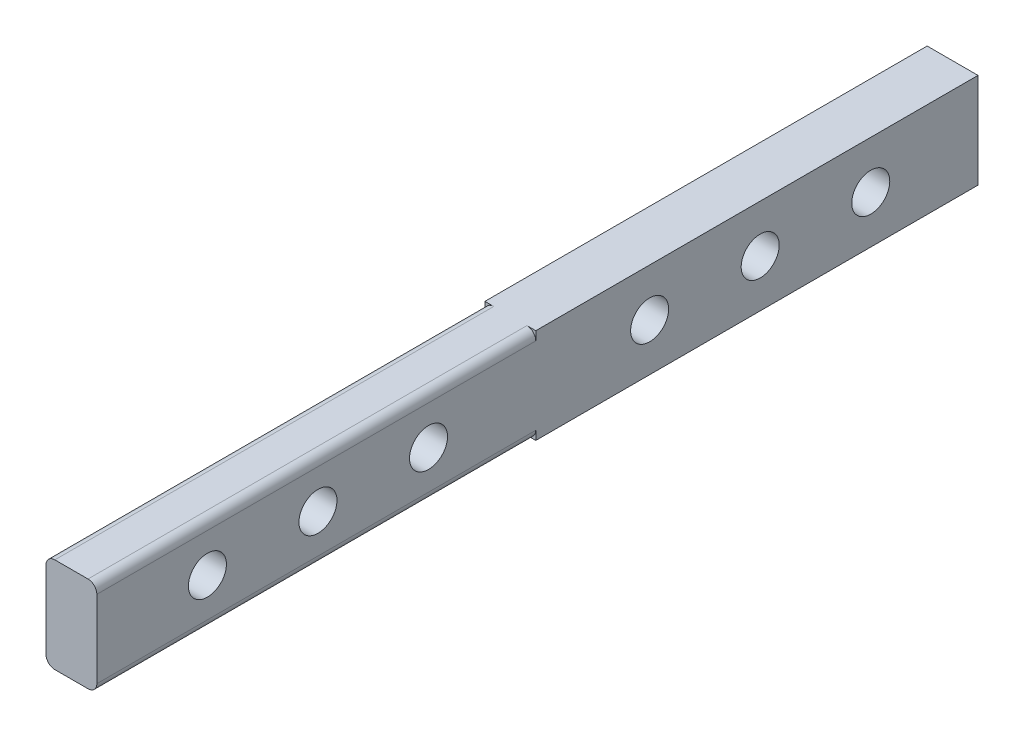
ISO-10303-21;
HEADER;
FILE_DESCRIPTION(('STEP AP214'),'2;1');
FILE_NAME('part.step','',(''),(''),'','','');
FILE_SCHEMA(('AUTOMOTIVE_DESIGN { 1 0 10303 214 1 1 1 1 }'));
ENDSEC;
DATA;
#1=APPLICATION_CONTEXT('core data for automotive mechanical design processes');
#2=APPLICATION_PROTOCOL_DEFINITION('international standard','automotive_design',2000,#1);
#3=PRODUCT_CONTEXT('',#1,'mechanical');
#4=PRODUCT('Part','Part','',(#3));
#5=PRODUCT_RELATED_PRODUCT_CATEGORY('part','',(#4));
#6=PRODUCT_DEFINITION_FORMATION('','',#4);
#7=PRODUCT_DEFINITION_CONTEXT('part definition',#1,'design');
#8=PRODUCT_DEFINITION('design','',#6,#7);
#9=PRODUCT_DEFINITION_SHAPE('','',#8);
#10=(LENGTH_UNIT() NAMED_UNIT(*) SI_UNIT(.MILLI.,.METRE.));
#11=(NAMED_UNIT(*) PLANE_ANGLE_UNIT() SI_UNIT($,.RADIAN.));
#12=(NAMED_UNIT(*) SI_UNIT($,.STERADIAN.) SOLID_ANGLE_UNIT());
#13=UNCERTAINTY_MEASURE_WITH_UNIT(LENGTH_MEASURE(1.E-05),#10,'distance_accuracy_value','');
#14=(GEOMETRIC_REPRESENTATION_CONTEXT(3) GLOBAL_UNCERTAINTY_ASSIGNED_CONTEXT((#13)) GLOBAL_UNIT_ASSIGNED_CONTEXT((#10,
#11,#12)) REPRESENTATION_CONTEXT('',''));
#15=CARTESIAN_POINT('',(0.,0.,0.));
#16=DIRECTION('',(0.,0.,1.));
#17=DIRECTION('',(1.,0.,0.));
#18=AXIS2_PLACEMENT_3D('',#15,#16,#17);
#19=CARTESIAN_POINT('',(2.875,5.375,49.6264199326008));
#20=DIRECTION('',(-1.,0.,0.));
#21=DIRECTION('',(0.,0.,1.));
#22=AXIS2_PLACEMENT_3D('',#19,#20,#21);
#23=PLANE('',#22);
#24=CARTESIAN_POINT('',(2.875,0.,37.1264199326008));
#25=DIRECTION('',(1.,0.,0.));
#26=DIRECTION('',(0.,0.,-1.));
#27=AXIS2_PLACEMENT_3D('',#24,#25,#26);
#28=CIRCLE('',#27,2.15);
#29=CARTESIAN_POINT('',(2.875,0.,34.9764199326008));
#30=VERTEX_POINT('',#29);
#31=EDGE_CURVE('E227',#30,#30,#28,.T.);
#32=ORIENTED_EDGE('',*,*,#31,.F.);
#33=EDGE_LOOP('',(#32));
#34=FACE_BOUND('',#33,.T.);
#35=CARTESIAN_POINT('',(2.875,0.,24.6264199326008));
#36=DIRECTION('',(1.,0.,0.));
#37=DIRECTION('',(0.,0.,-1.));
#38=AXIS2_PLACEMENT_3D('',#35,#36,#37);
#39=CIRCLE('',#38,2.15);
#40=CARTESIAN_POINT('',(2.875,0.,22.4764199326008));
#41=VERTEX_POINT('',#40);
#42=EDGE_CURVE('E237',#41,#41,#39,.T.);
#43=ORIENTED_EDGE('',*,*,#42,.F.);
#44=EDGE_LOOP('',(#43));
#45=FACE_BOUND('',#44,.T.);
#46=CARTESIAN_POINT('',(2.875,0.,12.1264199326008));
#47=DIRECTION('',(1.,0.,0.));
#48=DIRECTION('',(0.,0.,-1.));
#49=AXIS2_PLACEMENT_3D('',#46,#47,#48);
#50=CIRCLE('',#49,2.15);
#51=CARTESIAN_POINT('',(2.875,0.,9.97641993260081));
#52=VERTEX_POINT('',#51);
#53=EDGE_CURVE('E243',#52,#52,#50,.T.);
#54=ORIENTED_EDGE('',*,*,#53,.F.);
#55=EDGE_LOOP('',(#54));
#56=FACE_BOUND('',#55,.T.);
#57=CARTESIAN_POINT('',(2.875,0.,-12.8735800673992));
#58=DIRECTION('',(1.,0.,0.));
#59=DIRECTION('',(0.,0.,-1.));
#60=AXIS2_PLACEMENT_3D('',#57,#58,#59);
#61=CIRCLE('',#60,2.15);
#62=CARTESIAN_POINT('',(2.875,0.,-15.0235800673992));
#63=VERTEX_POINT('',#62);
#64=EDGE_CURVE('E249',#63,#63,#61,.T.);
#65=ORIENTED_EDGE('',*,*,#64,.F.);
#66=EDGE_LOOP('',(#65));
#67=FACE_BOUND('',#66,.T.);
#68=CARTESIAN_POINT('',(2.875,0.,-25.3735800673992));
#69=DIRECTION('',(1.,0.,0.));
#70=DIRECTION('',(0.,0.,-1.));
#71=AXIS2_PLACEMENT_3D('',#68,#69,#70);
#72=CIRCLE('',#71,2.15);
#73=CARTESIAN_POINT('',(2.875,0.,-27.5235800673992));
#74=VERTEX_POINT('',#73);
#75=EDGE_CURVE('E255',#74,#74,#72,.T.);
#76=ORIENTED_EDGE('',*,*,#75,.F.);
#77=EDGE_LOOP('',(#76));
#78=FACE_BOUND('',#77,.T.);
#79=CARTESIAN_POINT('',(2.875,0.,-37.8735800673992));
#80=DIRECTION('',(1.,0.,0.));
#81=DIRECTION('',(0.,0.,-1.));
#82=AXIS2_PLACEMENT_3D('',#79,#80,#81);
#83=CIRCLE('',#82,2.15);
#84=CARTESIAN_POINT('',(2.875,0.,-40.0235800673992));
#85=VERTEX_POINT('',#84);
#86=EDGE_CURVE('E157',#85,#85,#83,.T.);
#87=ORIENTED_EDGE('',*,*,#86,.F.);
#88=EDGE_LOOP('',(#87));
#89=FACE_BOUND('',#88,.T.);
#90=DIRECTION('',(0.,1.,0.));
#91=VECTOR('',#90,1.);
#92=CARTESIAN_POINT('',(2.875,5.375,49.6264199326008));
#93=LINE('',#92,#91);
#94=CARTESIAN_POINT('',(2.875,-4.375,49.6264199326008));
#95=VERTEX_POINT('',#94);
#96=CARTESIAN_POINT('',(2.875,4.375,49.6264199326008));
#97=VERTEX_POINT('',#96);
#98=EDGE_CURVE('E173',#95,#97,#93,.T.);
#99=ORIENTED_EDGE('',*,*,#98,.F.);
#100=DIRECTION('',(0.,0.,-1.));
#101=VECTOR('',#100,1.);
#102=CARTESIAN_POINT('',(2.875,-4.375,49.6264199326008));
#103=LINE('',#102,#101);
#104=CARTESIAN_POINT('',(2.875,-4.375,0.));
#105=VERTEX_POINT('',#104);
#106=EDGE_CURVE('E189',#95,#105,#103,.T.);
#107=ORIENTED_EDGE('',*,*,#106,.T.);
#108=DIRECTION('',(0.,1.,0.));
#109=VECTOR('',#108,1.);
#110=CARTESIAN_POINT('',(2.875,5.375,0.));
#111=LINE('',#110,#109);
#112=CARTESIAN_POINT('',(2.875,-5.375,0.));
#113=VERTEX_POINT('',#112);
#114=EDGE_CURVE('E162',#113,#105,#111,.T.);
#115=ORIENTED_EDGE('',*,*,#114,.F.);
#116=DIRECTION('',(0.,0.,1.));
#117=VECTOR('',#116,1.);
#118=CARTESIAN_POINT('',(2.875,-5.375,-50.));
#119=LINE('',#118,#117);
#120=CARTESIAN_POINT('',(2.875,-5.375,-50.));
#121=VERTEX_POINT('',#120);
#122=EDGE_CURVE('E150',#121,#113,#119,.T.);
#123=ORIENTED_EDGE('',*,*,#122,.F.);
#124=DIRECTION('',(0.,1.,0.));
#125=VECTOR('',#124,1.);
#126=CARTESIAN_POINT('',(2.875,5.375,-50.));
#127=LINE('',#126,#125);
#128=CARTESIAN_POINT('',(2.875,5.375,-50.));
#129=VERTEX_POINT('',#128);
#130=EDGE_CURVE('E142',#121,#129,#127,.T.);
#131=ORIENTED_EDGE('',*,*,#130,.T.);
#132=DIRECTION('',(0.,0.,1.));
#133=VECTOR('',#132,1.);
#134=CARTESIAN_POINT('',(2.875,5.375,-50.));
#135=LINE('',#134,#133);
#136=CARTESIAN_POINT('',(2.875,5.375,0.));
#137=VERTEX_POINT('',#136);
#138=EDGE_CURVE('E123',#129,#137,#135,.T.);
#139=ORIENTED_EDGE('',*,*,#138,.T.);
#140=CARTESIAN_POINT('',(2.875,4.375,0.));
#141=VERTEX_POINT('',#140);
#142=EDGE_CURVE('E166',#141,#137,#111,.T.);
#143=ORIENTED_EDGE('',*,*,#142,.F.);
#144=DIRECTION('',(0.,0.,-1.));
#145=VECTOR('',#144,1.);
#146=CARTESIAN_POINT('',(2.875,4.375,49.6264199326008));
#147=LINE('',#146,#145);
#148=EDGE_CURVE('E187',#141,#97,#147,.F.);
#149=ORIENTED_EDGE('',*,*,#148,.T.);
#150=EDGE_LOOP('',(#99,#107,#115,#123,#131,#139,#143,#149));
#151=FACE_BOUND('',#150,.T.);
#152=ADVANCED_FACE('F33',(#34,#45,#56,#67,#78,#89,#151),#23,.F.);
#153=CARTESIAN_POINT('',(-2.875,5.375,49.6264199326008));
#154=DIRECTION('',(0.,-1.,0.));
#155=DIRECTION('',(0.,0.,-1.));
#156=AXIS2_PLACEMENT_3D('',#153,#154,#155);
#157=PLANE('',#156);
#158=DIRECTION('',(0.,0.,-1.));
#159=VECTOR('',#158,1.);
#160=CARTESIAN_POINT('',(1.875,5.375,49.6264199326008));
#161=LINE('',#160,#159);
#162=CARTESIAN_POINT('',(1.875,5.375,49.6264199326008));
#163=VERTEX_POINT('',#162);
#164=CARTESIAN_POINT('',(1.875,5.375,0.));
#165=VERTEX_POINT('',#164);
#166=EDGE_CURVE('E41',#163,#165,#161,.T.);
#167=ORIENTED_EDGE('',*,*,#166,.T.);
#168=DIRECTION('',(-1.,0.,0.));
#169=VECTOR('',#168,1.);
#170=CARTESIAN_POINT('',(-2.875,5.375,0.));
#171=LINE('',#170,#169);
#172=EDGE_CURVE('E130',#137,#165,#171,.T.);
#173=ORIENTED_EDGE('',*,*,#172,.F.);
#174=ORIENTED_EDGE('',*,*,#138,.F.);
#175=DIRECTION('',(-1.,0.,0.));
#176=VECTOR('',#175,1.);
#177=CARTESIAN_POINT('',(-2.875,5.375,-50.));
#178=LINE('',#177,#176);
#179=CARTESIAN_POINT('',(-2.875,5.375,-50.));
#180=VERTEX_POINT('',#179);
#181=EDGE_CURVE('E128',#129,#180,#178,.T.);
#182=ORIENTED_EDGE('',*,*,#181,.T.);
#183=DIRECTION('',(0.,0.,1.));
#184=VECTOR('',#183,1.);
#185=CARTESIAN_POINT('',(-2.875,5.375,-50.));
#186=LINE('',#185,#184);
#187=CARTESIAN_POINT('',(-2.875,5.375,0.));
#188=VERTEX_POINT('',#187);
#189=EDGE_CURVE('E134',#180,#188,#186,.T.);
#190=ORIENTED_EDGE('',*,*,#189,.T.);
#191=CARTESIAN_POINT('',(-1.875,5.375,0.));
#192=VERTEX_POINT('',#191);
#193=EDGE_CURVE('E165',#192,#188,#171,.T.);
#194=ORIENTED_EDGE('',*,*,#193,.F.);
#195=DIRECTION('',(0.,0.,-1.));
#196=VECTOR('',#195,1.);
#197=CARTESIAN_POINT('',(-1.875,5.375,49.6264199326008));
#198=LINE('',#197,#196);
#199=CARTESIAN_POINT('',(-1.875,5.375,49.6264199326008));
#200=VERTEX_POINT('',#199);
#201=EDGE_CURVE('E11',#192,#200,#198,.F.);
#202=ORIENTED_EDGE('',*,*,#201,.T.);
#203=DIRECTION('',(-1.,0.,0.));
#204=VECTOR('',#203,1.);
#205=CARTESIAN_POINT('',(-2.875,5.375,49.6264199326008));
#206=LINE('',#205,#204);
#207=EDGE_CURVE('E180',#163,#200,#206,.T.);
#208=ORIENTED_EDGE('',*,*,#207,.F.);
#209=EDGE_LOOP('',(#167,#173,#174,#182,#190,#194,#202,#208));
#210=FACE_BOUND('',#209,.T.);
#211=ADVANCED_FACE('F126',(#210),#157,.F.);
#212=CARTESIAN_POINT('',(-2.875,5.375,49.6264199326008));
#213=DIRECTION('',(1.,0.,0.));
#214=DIRECTION('',(0.,0.,-1.));
#215=AXIS2_PLACEMENT_3D('',#212,#213,#214);
#216=PLANE('',#215);
#217=CARTESIAN_POINT('',(-2.875,0.,37.1264199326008));
#218=DIRECTION('',(1.,0.,0.));
#219=DIRECTION('',(0.,0.,-1.));
#220=AXIS2_PLACEMENT_3D('',#217,#218,#219);
#221=CIRCLE('',#220,2.15);
#222=CARTESIAN_POINT('',(-2.875,0.,34.9764199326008));
#223=VERTEX_POINT('',#222);
#224=EDGE_CURVE('E225',#223,#223,#221,.T.);
#225=ORIENTED_EDGE('',*,*,#224,.T.);
#226=EDGE_LOOP('',(#225));
#227=FACE_BOUND('',#226,.T.);
#228=CARTESIAN_POINT('',(-2.875,0.,24.6264199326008));
#229=DIRECTION('',(1.,0.,0.));
#230=DIRECTION('',(0.,0.,-1.));
#231=AXIS2_PLACEMENT_3D('',#228,#229,#230);
#232=CIRCLE('',#231,2.15);
#233=CARTESIAN_POINT('',(-2.875,0.,22.4764199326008));
#234=VERTEX_POINT('',#233);
#235=EDGE_CURVE('E232',#234,#234,#232,.T.);
#236=ORIENTED_EDGE('',*,*,#235,.T.);
#237=EDGE_LOOP('',(#236));
#238=FACE_BOUND('',#237,.T.);
#239=CARTESIAN_POINT('',(-2.875,0.,12.1264199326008));
#240=DIRECTION('',(1.,0.,0.));
#241=DIRECTION('',(0.,0.,-1.));
#242=AXIS2_PLACEMENT_3D('',#239,#240,#241);
#243=CIRCLE('',#242,2.15);
#244=CARTESIAN_POINT('',(-2.875,0.,9.97641993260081));
#245=VERTEX_POINT('',#244);
#246=EDGE_CURVE('E240',#245,#245,#243,.T.);
#247=ORIENTED_EDGE('',*,*,#246,.T.);
#248=EDGE_LOOP('',(#247));
#249=FACE_BOUND('',#248,.T.);
#250=CARTESIAN_POINT('',(-2.875,0.,-12.8735800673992));
#251=DIRECTION('',(1.,0.,0.));
#252=DIRECTION('',(0.,0.,-1.));
#253=AXIS2_PLACEMENT_3D('',#250,#251,#252);
#254=CIRCLE('',#253,2.15);
#255=CARTESIAN_POINT('',(-2.875,0.,-15.0235800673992));
#256=VERTEX_POINT('',#255);
#257=EDGE_CURVE('E246',#256,#256,#254,.T.);
#258=ORIENTED_EDGE('',*,*,#257,.T.);
#259=EDGE_LOOP('',(#258));
#260=FACE_BOUND('',#259,.T.);
#261=CARTESIAN_POINT('',(-2.875,0.,-25.3735800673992));
#262=DIRECTION('',(1.,0.,0.));
#263=DIRECTION('',(0.,0.,-1.));
#264=AXIS2_PLACEMENT_3D('',#261,#262,#263);
#265=CIRCLE('',#264,2.15);
#266=CARTESIAN_POINT('',(-2.875,0.,-27.5235800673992));
#267=VERTEX_POINT('',#266);
#268=EDGE_CURVE('E252',#267,#267,#265,.T.);
#269=ORIENTED_EDGE('',*,*,#268,.T.);
#270=EDGE_LOOP('',(#269));
#271=FACE_BOUND('',#270,.T.);
#272=CARTESIAN_POINT('',(-2.875,0.,-37.8735800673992));
#273=DIRECTION('',(1.,0.,0.));
#274=DIRECTION('',(0.,0.,-1.));
#275=AXIS2_PLACEMENT_3D('',#272,#273,#274);
#276=CIRCLE('',#275,2.15);
#277=CARTESIAN_POINT('',(-2.875,0.,-40.0235800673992));
#278=VERTEX_POINT('',#277);
#279=EDGE_CURVE('E257',#278,#278,#276,.T.);
#280=ORIENTED_EDGE('',*,*,#279,.T.);
#281=EDGE_LOOP('',(#280));
#282=FACE_BOUND('',#281,.T.);
#283=DIRECTION('',(0.,0.,-1.));
#284=VECTOR('',#283,1.);
#285=CARTESIAN_POINT('',(-2.875,4.375,49.6264199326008));
#286=LINE('',#285,#284);
#287=CARTESIAN_POINT('',(-2.875,4.375,49.6264199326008));
#288=VERTEX_POINT('',#287);
#289=CARTESIAN_POINT('',(-2.875,4.375,0.));
#290=VERTEX_POINT('',#289);
#291=EDGE_CURVE('E216',#288,#290,#286,.T.);
#292=ORIENTED_EDGE('',*,*,#291,.T.);
#293=DIRECTION('',(0.,-1.,0.));
#294=VECTOR('',#293,1.);
#295=CARTESIAN_POINT('',(-2.875,5.375,0.));
#296=LINE('',#295,#294);
#297=EDGE_CURVE('E169',#188,#290,#296,.T.);
#298=ORIENTED_EDGE('',*,*,#297,.F.);
#299=ORIENTED_EDGE('',*,*,#189,.F.);
#300=DIRECTION('',(0.,-1.,0.));
#301=VECTOR('',#300,1.);
#302=CARTESIAN_POINT('',(-2.875,5.375,-50.));
#303=LINE('',#302,#301);
#304=CARTESIAN_POINT('',(-2.875,-5.375,-50.));
#305=VERTEX_POINT('',#304);
#306=EDGE_CURVE('E145',#180,#305,#303,.T.);
#307=ORIENTED_EDGE('',*,*,#306,.T.);
#308=DIRECTION('',(0.,0.,1.));
#309=VECTOR('',#308,1.);
#310=CARTESIAN_POINT('',(-2.875,-5.375,-50.));
#311=LINE('',#310,#309);
#312=CARTESIAN_POINT('',(-2.875,-5.375,0.));
#313=VERTEX_POINT('',#312);
#314=EDGE_CURVE('E174',#305,#313,#311,.T.);
#315=ORIENTED_EDGE('',*,*,#314,.T.);
#316=CARTESIAN_POINT('',(-2.875,-4.375,0.));
#317=VERTEX_POINT('',#316);
#318=EDGE_CURVE('E168',#317,#313,#296,.T.);
#319=ORIENTED_EDGE('',*,*,#318,.F.);
#320=DIRECTION('',(0.,0.,-1.));
#321=VECTOR('',#320,1.);
#322=CARTESIAN_POINT('',(-2.875,-4.375,49.6264199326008));
#323=LINE('',#322,#321);
#324=CARTESIAN_POINT('',(-2.875,-4.375,49.6264199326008));
#325=VERTEX_POINT('',#324);
#326=EDGE_CURVE('E48',#317,#325,#323,.F.);
#327=ORIENTED_EDGE('',*,*,#326,.T.);
#328=DIRECTION('',(0.,-1.,0.));
#329=VECTOR('',#328,1.);
#330=CARTESIAN_POINT('',(-2.875,5.375,49.6264199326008));
#331=LINE('',#330,#329);
#332=EDGE_CURVE('E182',#288,#325,#331,.T.);
#333=ORIENTED_EDGE('',*,*,#332,.F.);
#334=EDGE_LOOP('',(#292,#298,#299,#307,#315,#319,#327,#333));
#335=FACE_BOUND('',#334,.T.);
#336=ADVANCED_FACE('F272',(#227,#238,#249,#260,#271,#282,#335),#216,.F.);
#337=CARTESIAN_POINT('',(-2.875,-5.375,49.6264199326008));
#338=DIRECTION('',(0.,1.,0.));
#339=DIRECTION('',(0.,0.,1.));
#340=AXIS2_PLACEMENT_3D('',#337,#338,#339);
#341=PLANE('',#340);
#342=DIRECTION('',(0.,0.,-1.));
#343=VECTOR('',#342,1.);
#344=CARTESIAN_POINT('',(-1.875,-5.375,49.6264199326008));
#345=LINE('',#344,#343);
#346=CARTESIAN_POINT('',(-1.875,-5.375,49.6264199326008));
#347=VERTEX_POINT('',#346);
#348=CARTESIAN_POINT('',(-1.875,-5.375,0.));
#349=VERTEX_POINT('',#348);
#350=EDGE_CURVE('E204',#347,#349,#345,.T.);
#351=ORIENTED_EDGE('',*,*,#350,.T.);
#352=DIRECTION('',(1.,0.,0.));
#353=VECTOR('',#352,1.);
#354=CARTESIAN_POINT('',(-2.875,-5.375,0.));
#355=LINE('',#354,#353);
#356=EDGE_CURVE('E151',#313,#349,#355,.T.);
#357=ORIENTED_EDGE('',*,*,#356,.F.);
#358=ORIENTED_EDGE('',*,*,#314,.F.);
#359=DIRECTION('',(1.,0.,0.));
#360=VECTOR('',#359,1.);
#361=CARTESIAN_POINT('',(-2.875,-5.375,-50.));
#362=LINE('',#361,#360);
#363=EDGE_CURVE('E135',#305,#121,#362,.T.);
#364=ORIENTED_EDGE('',*,*,#363,.T.);
#365=ORIENTED_EDGE('',*,*,#122,.T.);
#366=CARTESIAN_POINT('',(1.875,-5.375,0.));
#367=VERTEX_POINT('',#366);
#368=EDGE_CURVE('E154',#367,#113,#355,.T.);
#369=ORIENTED_EDGE('',*,*,#368,.F.);
#370=DIRECTION('',(0.,0.,-1.));
#371=VECTOR('',#370,1.);
#372=CARTESIAN_POINT('',(1.875,-5.375,49.6264199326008));
#373=LINE('',#372,#371);
#374=CARTESIAN_POINT('',(1.875,-5.375,49.6264199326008));
#375=VERTEX_POINT('',#374);
#376=EDGE_CURVE('E207',#367,#375,#373,.F.);
#377=ORIENTED_EDGE('',*,*,#376,.T.);
#378=DIRECTION('',(1.,0.,0.));
#379=VECTOR('',#378,1.);
#380=CARTESIAN_POINT('',(-2.875,-5.375,49.6264199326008));
#381=LINE('',#380,#379);
#382=EDGE_CURVE('E184',#347,#375,#381,.T.);
#383=ORIENTED_EDGE('',*,*,#382,.F.);
#384=EDGE_LOOP('',(#351,#357,#358,#364,#365,#369,#377,#383));
#385=FACE_BOUND('',#384,.T.);
#386=ADVANCED_FACE('F300',(#385),#341,.F.);
#387=CARTESIAN_POINT('',(0.,0.,49.6264199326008));
#388=DIRECTION('',(0.,0.,1.));
#389=DIRECTION('',(1.,0.,0.));
#390=AXIS2_PLACEMENT_3D('',#387,#388,#389);
#391=PLANE('',#390);
#392=ORIENTED_EDGE('',*,*,#382,.T.);
#393=CARTESIAN_POINT('',(1.875,-4.375,49.6264199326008));
#394=DIRECTION('',(0.,0.,1.));
#395=DIRECTION('',(1.,0.,0.));
#396=AXIS2_PLACEMENT_3D('',#393,#394,#395);
#397=CIRCLE('',#396,1.);
#398=EDGE_CURVE('E214',#375,#95,#397,.T.);
#399=ORIENTED_EDGE('',*,*,#398,.T.);
#400=ORIENTED_EDGE('',*,*,#98,.T.);
#401=CARTESIAN_POINT('',(1.875,4.375,49.6264199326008));
#402=DIRECTION('',(0.,0.,1.));
#403=DIRECTION('',(1.,0.,0.));
#404=AXIS2_PLACEMENT_3D('',#401,#402,#403);
#405=CIRCLE('',#404,1.);
#406=EDGE_CURVE('E209',#97,#163,#405,.T.);
#407=ORIENTED_EDGE('',*,*,#406,.T.);
#408=ORIENTED_EDGE('',*,*,#207,.T.);
#409=CARTESIAN_POINT('',(-1.875,4.375,49.6264199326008));
#410=DIRECTION('',(0.,0.,1.));
#411=DIRECTION('',(1.,0.,0.));
#412=AXIS2_PLACEMENT_3D('',#409,#410,#411);
#413=CIRCLE('',#412,1.);
#414=EDGE_CURVE('E55',#200,#288,#413,.T.);
#415=ORIENTED_EDGE('',*,*,#414,.T.);
#416=ORIENTED_EDGE('',*,*,#332,.T.);
#417=CARTESIAN_POINT('',(-1.875,-4.375,49.6264199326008));
#418=DIRECTION('',(0.,0.,1.));
#419=DIRECTION('',(1.,0.,0.));
#420=AXIS2_PLACEMENT_3D('',#417,#418,#419);
#421=CIRCLE('',#420,1.);
#422=EDGE_CURVE('E212',#325,#347,#421,.T.);
#423=ORIENTED_EDGE('',*,*,#422,.T.);
#424=EDGE_LOOP('',(#392,#399,#400,#407,#408,#415,#416,#423));
#425=FACE_BOUND('',#424,.T.);
#426=ADVANCED_FACE('F282',(#425),#391,.T.);
#427=CARTESIAN_POINT('',(1.875,-4.375,49.6264199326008));
#428=DIRECTION('',(0.,0.,-1.));
#429=DIRECTION('',(-1.,0.,0.));
#430=AXIS2_PLACEMENT_3D('',#427,#428,#429);
#431=CYLINDRICAL_SURFACE('',#430,1.);
#432=ORIENTED_EDGE('',*,*,#398,.F.);
#433=ORIENTED_EDGE('',*,*,#376,.F.);
#434=CARTESIAN_POINT('',(1.875,-4.375,0.));
#435=DIRECTION('',(0.,0.,1.));
#436=DIRECTION('',(1.,0.,0.));
#437=AXIS2_PLACEMENT_3D('',#434,#435,#436);
#438=CIRCLE('',#437,1.);
#439=EDGE_CURVE('E201',#105,#367,#438,.F.);
#440=ORIENTED_EDGE('',*,*,#439,.F.);
#441=ORIENTED_EDGE('',*,*,#106,.F.);
#442=EDGE_LOOP('',(#432,#433,#440,#441));
#443=FACE_BOUND('',#442,.T.);
#444=ADVANCED_FACE('F278',(#443),#431,.T.);
#445=CARTESIAN_POINT('',(-1.875,-4.375,49.6264199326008));
#446=DIRECTION('',(0.,0.,-1.));
#447=DIRECTION('',(-1.,0.,0.));
#448=AXIS2_PLACEMENT_3D('',#445,#446,#447);
#449=CYLINDRICAL_SURFACE('',#448,1.);
#450=ORIENTED_EDGE('',*,*,#422,.F.);
#451=ORIENTED_EDGE('',*,*,#326,.F.);
#452=CARTESIAN_POINT('',(-1.875,-4.375,0.));
#453=DIRECTION('',(0.,0.,1.));
#454=DIRECTION('',(1.,0.,0.));
#455=AXIS2_PLACEMENT_3D('',#452,#453,#454);
#456=CIRCLE('',#455,1.);
#457=EDGE_CURVE('E198',#349,#317,#456,.F.);
#458=ORIENTED_EDGE('',*,*,#457,.F.);
#459=ORIENTED_EDGE('',*,*,#350,.F.);
#460=EDGE_LOOP('',(#450,#451,#458,#459));
#461=FACE_BOUND('',#460,.T.);
#462=ADVANCED_FACE('F281',(#461),#449,.T.);
#463=CARTESIAN_POINT('',(-1.875,4.375,49.6264199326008));
#464=DIRECTION('',(0.,0.,-1.));
#465=DIRECTION('',(-1.,0.,0.));
#466=AXIS2_PLACEMENT_3D('',#463,#464,#465);
#467=CYLINDRICAL_SURFACE('',#466,1.);
#468=ORIENTED_EDGE('',*,*,#414,.F.);
#469=ORIENTED_EDGE('',*,*,#201,.F.);
#470=CARTESIAN_POINT('',(-1.875,4.375,0.));
#471=DIRECTION('',(0.,0.,1.));
#472=DIRECTION('',(1.,0.,0.));
#473=AXIS2_PLACEMENT_3D('',#470,#471,#472);
#474=CIRCLE('',#473,1.);
#475=EDGE_CURVE('E195',#290,#192,#474,.F.);
#476=ORIENTED_EDGE('',*,*,#475,.F.);
#477=ORIENTED_EDGE('',*,*,#291,.F.);
#478=EDGE_LOOP('',(#468,#469,#476,#477));
#479=FACE_BOUND('',#478,.T.);
#480=ADVANCED_FACE('F285',(#479),#467,.T.);
#481=CARTESIAN_POINT('',(1.875,4.375,49.6264199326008));
#482=DIRECTION('',(0.,0.,-1.));
#483=DIRECTION('',(-1.,0.,0.));
#484=AXIS2_PLACEMENT_3D('',#481,#482,#483);
#485=CYLINDRICAL_SURFACE('',#484,1.);
#486=ORIENTED_EDGE('',*,*,#406,.F.);
#487=ORIENTED_EDGE('',*,*,#148,.F.);
#488=CARTESIAN_POINT('',(1.875,4.375,0.));
#489=DIRECTION('',(0.,0.,1.));
#490=DIRECTION('',(1.,0.,0.));
#491=AXIS2_PLACEMENT_3D('',#488,#489,#490);
#492=CIRCLE('',#491,1.);
#493=EDGE_CURVE('E192',#165,#141,#492,.F.);
#494=ORIENTED_EDGE('',*,*,#493,.F.);
#495=ORIENTED_EDGE('',*,*,#166,.F.);
#496=EDGE_LOOP('',(#486,#487,#494,#495));
#497=FACE_BOUND('',#496,.T.);
#498=ADVANCED_FACE('F35',(#497),#485,.T.);
#499=CARTESIAN_POINT('',(0.,0.,0.));
#500=DIRECTION('',(0.,0.,1.));
#501=DIRECTION('',(1.,0.,0.));
#502=AXIS2_PLACEMENT_3D('',#499,#500,#501);
#503=PLANE('',#502);
#504=ORIENTED_EDGE('',*,*,#114,.T.);
#505=ORIENTED_EDGE('',*,*,#439,.T.);
#506=ORIENTED_EDGE('',*,*,#368,.T.);
#507=EDGE_LOOP('',(#504,#505,#506));
#508=FACE_BOUND('',#507,.T.);
#509=ADVANCED_FACE('F292',(#508),#503,.T.);
#510=ORIENTED_EDGE('',*,*,#356,.T.);
#511=ORIENTED_EDGE('',*,*,#457,.T.);
#512=ORIENTED_EDGE('',*,*,#318,.T.);
#513=EDGE_LOOP('',(#510,#511,#512));
#514=FACE_BOUND('',#513,.T.);
#515=ADVANCED_FACE('F305',(#514),#503,.T.);
#516=ORIENTED_EDGE('',*,*,#297,.T.);
#517=ORIENTED_EDGE('',*,*,#475,.T.);
#518=ORIENTED_EDGE('',*,*,#193,.T.);
#519=EDGE_LOOP('',(#516,#517,#518));
#520=FACE_BOUND('',#519,.T.);
#521=ADVANCED_FACE('F296',(#520),#503,.T.);
#522=CARTESIAN_POINT('',(0.,0.,-50.));
#523=DIRECTION('',(0.,0.,1.));
#524=DIRECTION('',(1.,0.,0.));
#525=AXIS2_PLACEMENT_3D('',#522,#523,#524);
#526=PLANE('',#525);
#527=ORIENTED_EDGE('',*,*,#130,.F.);
#528=ORIENTED_EDGE('',*,*,#363,.F.);
#529=ORIENTED_EDGE('',*,*,#306,.F.);
#530=ORIENTED_EDGE('',*,*,#181,.F.);
#531=EDGE_LOOP('',(#527,#528,#529,#530));
#532=FACE_BOUND('',#531,.T.);
#533=ADVANCED_FACE('F140',(#532),#526,.F.);
#534=ORIENTED_EDGE('',*,*,#172,.T.);
#535=ORIENTED_EDGE('',*,*,#493,.T.);
#536=ORIENTED_EDGE('',*,*,#142,.T.);
#537=EDGE_LOOP('',(#534,#535,#536));
#538=FACE_BOUND('',#537,.T.);
#539=ADVANCED_FACE('F224',(#538),#503,.T.);
#540=CARTESIAN_POINT('',(-2.875,0.,-37.8735800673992));
#541=DIRECTION('',(1.,0.,0.));
#542=DIRECTION('',(0.,0.,-1.));
#543=AXIS2_PLACEMENT_3D('',#540,#541,#542);
#544=CYLINDRICAL_SURFACE('',#543,2.15);
#545=ORIENTED_EDGE('',*,*,#279,.F.);
#546=EDGE_LOOP('',(#545));
#547=FACE_BOUND('',#546,.T.);
#548=ORIENTED_EDGE('',*,*,#86,.T.);
#549=EDGE_LOOP('',(#548));
#550=FACE_BOUND('',#549,.T.);
#551=ADVANCED_FACE('F264',(#547,#550),#544,.F.);
#552=CARTESIAN_POINT('',(-2.875,0.,-25.3735800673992));
#553=DIRECTION('',(1.,0.,0.));
#554=DIRECTION('',(0.,0.,-1.));
#555=AXIS2_PLACEMENT_3D('',#552,#553,#554);
#556=CYLINDRICAL_SURFACE('',#555,2.15);
#557=ORIENTED_EDGE('',*,*,#268,.F.);
#558=EDGE_LOOP('',(#557));
#559=FACE_BOUND('',#558,.T.);
#560=ORIENTED_EDGE('',*,*,#75,.T.);
#561=EDGE_LOOP('',(#560));
#562=FACE_BOUND('',#561,.T.);
#563=ADVANCED_FACE('F322',(#559,#562),#556,.F.);
#564=CARTESIAN_POINT('',(-2.875,0.,-12.8735800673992));
#565=DIRECTION('',(1.,0.,0.));
#566=DIRECTION('',(0.,0.,-1.));
#567=AXIS2_PLACEMENT_3D('',#564,#565,#566);
#568=CYLINDRICAL_SURFACE('',#567,2.15);
#569=ORIENTED_EDGE('',*,*,#257,.F.);
#570=EDGE_LOOP('',(#569));
#571=FACE_BOUND('',#570,.T.);
#572=ORIENTED_EDGE('',*,*,#64,.T.);
#573=EDGE_LOOP('',(#572));
#574=FACE_BOUND('',#573,.T.);
#575=ADVANCED_FACE('F370',(#571,#574),#568,.F.);
#576=CARTESIAN_POINT('',(-2.875,0.,12.1264199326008));
#577=DIRECTION('',(1.,0.,0.));
#578=DIRECTION('',(0.,0.,-1.));
#579=AXIS2_PLACEMENT_3D('',#576,#577,#578);
#580=CYLINDRICAL_SURFACE('',#579,2.15);
#581=ORIENTED_EDGE('',*,*,#246,.F.);
#582=EDGE_LOOP('',(#581));
#583=FACE_BOUND('',#582,.T.);
#584=ORIENTED_EDGE('',*,*,#53,.T.);
#585=EDGE_LOOP('',(#584));
#586=FACE_BOUND('',#585,.T.);
#587=ADVANCED_FACE('F380',(#583,#586),#580,.F.);
#588=CARTESIAN_POINT('',(-2.875,0.,24.6264199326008));
#589=DIRECTION('',(1.,0.,0.));
#590=DIRECTION('',(0.,0.,-1.));
#591=AXIS2_PLACEMENT_3D('',#588,#589,#590);
#592=CYLINDRICAL_SURFACE('',#591,2.15);
#593=ORIENTED_EDGE('',*,*,#235,.F.);
#594=EDGE_LOOP('',(#593));
#595=FACE_BOUND('',#594,.T.);
#596=ORIENTED_EDGE('',*,*,#42,.T.);
#597=EDGE_LOOP('',(#596));
#598=FACE_BOUND('',#597,.T.);
#599=ADVANCED_FACE('F390',(#595,#598),#592,.F.);
#600=CARTESIAN_POINT('',(-2.875,0.,37.1264199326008));
#601=DIRECTION('',(1.,0.,0.));
#602=DIRECTION('',(0.,0.,-1.));
#603=AXIS2_PLACEMENT_3D('',#600,#601,#602);
#604=CYLINDRICAL_SURFACE('',#603,2.15);
#605=ORIENTED_EDGE('',*,*,#224,.F.);
#606=EDGE_LOOP('',(#605));
#607=FACE_BOUND('',#606,.T.);
#608=ORIENTED_EDGE('',*,*,#31,.T.);
#609=EDGE_LOOP('',(#608));
#610=FACE_BOUND('',#609,.T.);
#611=ADVANCED_FACE('F400',(#607,#610),#604,.F.);
#612=CLOSED_SHELL('',(#152,#211,#336,#386,#426,#444,#462,#480,#498,#509,#515,#521,#533,#539,
#551,#563,#575,#587,#599,#611));
#613=MANIFOLD_SOLID_BREP('B2',#612);
#614=ADVANCED_BREP_SHAPE_REPRESENTATION('',(#18,#613),#14);
#615=SHAPE_DEFINITION_REPRESENTATION(#9,#614);
ENDSEC;
END-ISO-10303-21;
